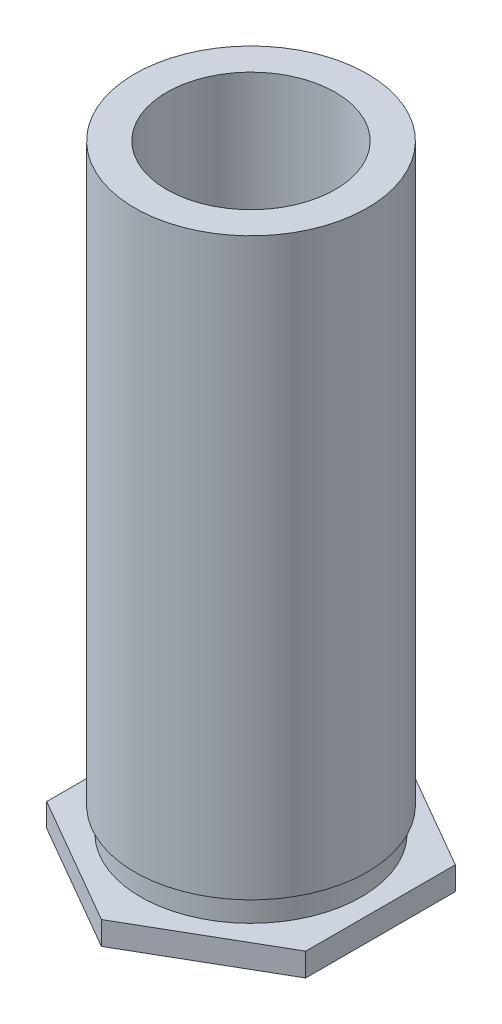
from build123d import *

# Parameters (mm, degrees)
HEXDIESKE_R  = 4.609084
HEXDIE_DEPTH = 0.7112


with BuildPart() as part:
    # BodySke → Body (revolve)
    with BuildSketch(Plane.XY, mode=Mode.PRIVATE) as body_sk:
        Polygon((3.556, 0), (4.596384, 0), (4.596384, 0.7112), (3.3782, 0.7112), (3.3782, 1.45796), (3.556, 1.45796), (3.556, 19.05), (1.94056, 19.05), (1.94056, 0.00508), (0, 0.00508), (0, 0.00254), (3.556, 0.00254), align=None)
    revolve(body_sk.sketch.rotate(Axis((0, 0, 0), (0, 1, 0)), 90), axis=Axis((0, 0, 0), (0, 1, 0)))

    # TapDriSke → TapDrill (revolve, cut)
    with BuildSketch(Plane.XY, mode=Mode.PRIVATE) as tapdrill_sk:
        Polygon((1.94056, -3.95732), (1.94056, 19.05), (0, 19.05), (0, -4.761126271), align=None)
    revolve(tapdrill_sk.sketch.rotate(Axis((0, 0, 0), (0, 1, 0)), 90), axis=Axis((0, 0, 0), (0, 1, 0)), mode=Mode.SUBTRACT)

    # EndChamferSke → EndChamfer (revolve, cut)
    with BuildSketch(Plane.XY, mode=Mode.PRIVATE) as endchamfer_sk:
        Polygon((2.5781, 11.1252), (2.5781, 19.304), (1.94056, 19.304), (1.94056, 10.79451682), (2.413, 11.1252), align=None)
    revolve(endchamfer_sk.sketch.rotate(Axis((0, -2.54, 0), (0, 1, 0)), 90), axis=Axis((0, -2.54, 0), (0, 1, 0)), mode=Mode.SUBTRACT)

    # HexDieSke → HexDie (cut)
    with BuildSketch(Plane(origin=(0, 0.7112, 0), x_dir=(-1, 0, 0), z_dir=(0, 1, 0))):
        Circle(HEXDIESKE_R)
        Polygon((0, 4.575385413), (3.9624, 2.287692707), (3.9624, -2.287692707), (0, -4.575385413), (-3.9624, -2.287692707), (-3.9624, 2.287692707), align=None, mode=Mode.SUBTRACT)
    extrude(amount=-HEXDIE_DEPTH, mode=Mode.SUBTRACT)


solid = part.part
